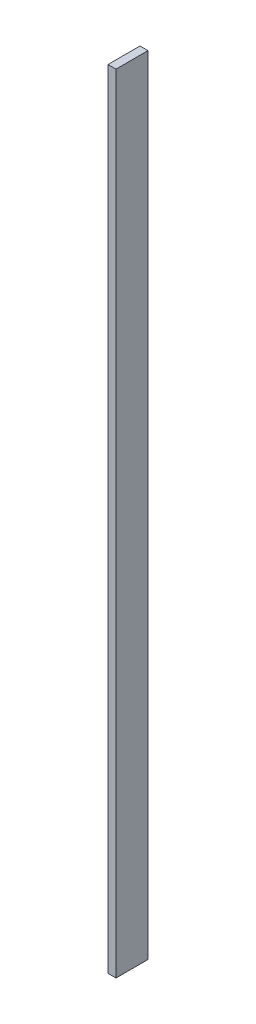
ISO-10303-21;
HEADER;
FILE_DESCRIPTION(('STEP AP214'),'2;1');
FILE_NAME('part.step','',(''),(''),'','','');
FILE_SCHEMA(('AUTOMOTIVE_DESIGN { 1 0 10303 214 1 1 1 1 }'));
ENDSEC;
DATA;
#1=APPLICATION_CONTEXT('core data for automotive mechanical design processes');
#2=APPLICATION_PROTOCOL_DEFINITION('international standard','automotive_design',2000,#1);
#3=PRODUCT_CONTEXT('',#1,'mechanical');
#4=PRODUCT('Part','Part','',(#3));
#5=PRODUCT_RELATED_PRODUCT_CATEGORY('part','',(#4));
#6=PRODUCT_DEFINITION_FORMATION('','',#4);
#7=PRODUCT_DEFINITION_CONTEXT('part definition',#1,'design');
#8=PRODUCT_DEFINITION('design','',#6,#7);
#9=PRODUCT_DEFINITION_SHAPE('','',#8);
#10=(LENGTH_UNIT() NAMED_UNIT(*) SI_UNIT(.MILLI.,.METRE.));
#11=(NAMED_UNIT(*) PLANE_ANGLE_UNIT() SI_UNIT($,.RADIAN.));
#12=(NAMED_UNIT(*) SI_UNIT($,.STERADIAN.) SOLID_ANGLE_UNIT());
#13=UNCERTAINTY_MEASURE_WITH_UNIT(LENGTH_MEASURE(1.E-05),#10,'distance_accuracy_value','');
#14=(GEOMETRIC_REPRESENTATION_CONTEXT(3) GLOBAL_UNCERTAINTY_ASSIGNED_CONTEXT((#13)) GLOBAL_UNIT_ASSIGNED_CONTEXT((#10,
#11,#12)) REPRESENTATION_CONTEXT('',''));
#15=CARTESIAN_POINT('',(0.,0.,0.));
#16=DIRECTION('',(0.,0.,1.));
#17=DIRECTION('',(1.,0.,0.));
#18=AXIS2_PLACEMENT_3D('',#15,#16,#17);
#19=CARTESIAN_POINT('',(6.35,0.,0.));
#20=DIRECTION('',(0.,0.,-1.));
#21=DIRECTION('',(0.,1.,0.));
#22=AXIS2_PLACEMENT_3D('',#19,#20,#21);
#23=PLANE('',#22);
#24=DIRECTION('',(0.,-1.,0.));
#25=VECTOR('',#24,1.);
#26=CARTESIAN_POINT('',(0.,0.,0.));
#27=LINE('',#26,#25);
#28=CARTESIAN_POINT('',(0.,0.,0.));
#29=VERTEX_POINT('',#28);
#30=CARTESIAN_POINT('',(0.,-624.84,0.));
#31=VERTEX_POINT('',#30);
#32=EDGE_CURVE('E96',#29,#31,#27,.T.);
#33=ORIENTED_EDGE('',*,*,#32,.T.);
#34=DIRECTION('',(-1.,0.,0.));
#35=VECTOR('',#34,1.);
#36=CARTESIAN_POINT('',(6.35,-624.84,0.));
#37=LINE('',#36,#35);
#38=CARTESIAN_POINT('',(6.35,-624.84,0.));
#39=VERTEX_POINT('',#38);
#40=EDGE_CURVE('E11',#39,#31,#37,.T.);
#41=ORIENTED_EDGE('',*,*,#40,.F.);
#42=DIRECTION('',(0.,-1.,0.));
#43=VECTOR('',#42,1.);
#44=CARTESIAN_POINT('',(6.35,0.,0.));
#45=LINE('',#44,#43);
#46=CARTESIAN_POINT('',(6.35,0.,0.));
#47=VERTEX_POINT('',#46);
#48=EDGE_CURVE('E84',#47,#39,#45,.T.);
#49=ORIENTED_EDGE('',*,*,#48,.F.);
#50=DIRECTION('',(-1.,0.,0.));
#51=VECTOR('',#50,1.);
#52=CARTESIAN_POINT('',(6.35,0.,0.));
#53=LINE('',#52,#51);
#54=EDGE_CURVE('E92',#47,#29,#53,.T.);
#55=ORIENTED_EDGE('',*,*,#54,.T.);
#56=EDGE_LOOP('',(#33,#41,#49,#55));
#57=FACE_BOUND('',#56,.T.);
#58=ADVANCED_FACE('F33',(#57),#23,.F.);
#59=CARTESIAN_POINT('',(6.35,-624.84,0.));
#60=DIRECTION('',(0.,1.,0.));
#61=DIRECTION('',(0.,0.,1.));
#62=AXIS2_PLACEMENT_3D('',#59,#60,#61);
#63=PLANE('',#62);
#64=DIRECTION('',(0.,0.,-1.));
#65=VECTOR('',#64,1.);
#66=CARTESIAN_POINT('',(0.,-624.84,0.));
#67=LINE('',#66,#65);
#68=CARTESIAN_POINT('',(0.,-624.84,-25.4000000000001));
#69=VERTEX_POINT('',#68);
#70=EDGE_CURVE('E88',#31,#69,#67,.T.);
#71=ORIENTED_EDGE('',*,*,#70,.T.);
#72=DIRECTION('',(-1.,0.,0.));
#73=VECTOR('',#72,1.);
#74=CARTESIAN_POINT('',(6.35,-624.84,-25.4000000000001));
#75=LINE('',#74,#73);
#76=CARTESIAN_POINT('',(6.35,-624.84,-25.4000000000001));
#77=VERTEX_POINT('',#76);
#78=EDGE_CURVE('E41',#77,#69,#75,.T.);
#79=ORIENTED_EDGE('',*,*,#78,.F.);
#80=DIRECTION('',(0.,0.,-1.));
#81=VECTOR('',#80,1.);
#82=CARTESIAN_POINT('',(6.35,-624.84,0.));
#83=LINE('',#82,#81);
#84=EDGE_CURVE('E79',#39,#77,#83,.T.);
#85=ORIENTED_EDGE('',*,*,#84,.F.);
#86=ORIENTED_EDGE('',*,*,#40,.T.);
#87=EDGE_LOOP('',(#71,#79,#85,#86));
#88=FACE_BOUND('',#87,.T.);
#89=ADVANCED_FACE('F87',(#88),#63,.F.);
#90=CARTESIAN_POINT('',(6.35,0.,-25.4));
#91=DIRECTION('',(0.,0.,1.));
#92=DIRECTION('',(0.,-1.,0.));
#93=AXIS2_PLACEMENT_3D('',#90,#91,#92);
#94=PLANE('',#93);
#95=DIRECTION('',(0.,1.,0.));
#96=VECTOR('',#95,1.);
#97=CARTESIAN_POINT('',(0.,0.,-25.4));
#98=LINE('',#97,#96);
#99=CARTESIAN_POINT('',(0.,0.,-25.4));
#100=VERTEX_POINT('',#99);
#101=EDGE_CURVE('E66',#69,#100,#98,.T.);
#102=ORIENTED_EDGE('',*,*,#101,.T.);
#103=DIRECTION('',(-1.,0.,0.));
#104=VECTOR('',#103,1.);
#105=CARTESIAN_POINT('',(6.35,0.,-25.4));
#106=LINE('',#105,#104);
#107=CARTESIAN_POINT('',(6.35,0.,-25.4));
#108=VERTEX_POINT('',#107);
#109=EDGE_CURVE('E89',#108,#100,#106,.T.);
#110=ORIENTED_EDGE('',*,*,#109,.F.);
#111=DIRECTION('',(0.,1.,0.));
#112=VECTOR('',#111,1.);
#113=CARTESIAN_POINT('',(6.35,0.,-25.4));
#114=LINE('',#113,#112);
#115=EDGE_CURVE('E82',#77,#108,#114,.T.);
#116=ORIENTED_EDGE('',*,*,#115,.F.);
#117=ORIENTED_EDGE('',*,*,#78,.T.);
#118=EDGE_LOOP('',(#102,#110,#116,#117));
#119=FACE_BOUND('',#118,.T.);
#120=ADVANCED_FACE('F90',(#119),#94,.F.);
#121=CARTESIAN_POINT('',(6.35,0.,0.));
#122=DIRECTION('',(0.,-1.,0.));
#123=DIRECTION('',(0.,0.,-1.));
#124=AXIS2_PLACEMENT_3D('',#121,#122,#123);
#125=PLANE('',#124);
#126=DIRECTION('',(0.,0.,1.));
#127=VECTOR('',#126,1.);
#128=CARTESIAN_POINT('',(0.,0.,0.));
#129=LINE('',#128,#127);
#130=EDGE_CURVE('E72',#100,#29,#129,.T.);
#131=ORIENTED_EDGE('',*,*,#130,.T.);
#132=ORIENTED_EDGE('',*,*,#54,.F.);
#133=DIRECTION('',(0.,0.,1.));
#134=VECTOR('',#133,1.);
#135=CARTESIAN_POINT('',(6.35,0.,0.));
#136=LINE('',#135,#134);
#137=EDGE_CURVE('E49',#108,#47,#136,.T.);
#138=ORIENTED_EDGE('',*,*,#137,.F.);
#139=ORIENTED_EDGE('',*,*,#109,.T.);
#140=EDGE_LOOP('',(#131,#132,#138,#139));
#141=FACE_BOUND('',#140,.T.);
#142=ADVANCED_FACE('F103',(#141),#125,.F.);
#143=CARTESIAN_POINT('',(6.35,0.,0.));
#144=DIRECTION('',(1.,0.,0.));
#145=DIRECTION('',(0.,0.,-1.));
#146=AXIS2_PLACEMENT_3D('',#143,#144,#145);
#147=PLANE('',#146);
#148=ORIENTED_EDGE('',*,*,#48,.T.);
#149=ORIENTED_EDGE('',*,*,#84,.T.);
#150=ORIENTED_EDGE('',*,*,#115,.T.);
#151=ORIENTED_EDGE('',*,*,#137,.T.);
#152=EDGE_LOOP('',(#148,#149,#150,#151));
#153=FACE_BOUND('',#152,.T.);
#154=ADVANCED_FACE('F80',(#153),#147,.T.);
#155=CARTESIAN_POINT('',(0.,0.,0.));
#156=DIRECTION('',(1.,0.,0.));
#157=DIRECTION('',(0.,0.,-1.));
#158=AXIS2_PLACEMENT_3D('',#155,#156,#157);
#159=PLANE('',#158);
#160=ORIENTED_EDGE('',*,*,#32,.F.);
#161=ORIENTED_EDGE('',*,*,#130,.F.);
#162=ORIENTED_EDGE('',*,*,#101,.F.);
#163=ORIENTED_EDGE('',*,*,#70,.F.);
#164=EDGE_LOOP('',(#160,#161,#162,#163));
#165=FACE_BOUND('',#164,.T.);
#166=ADVANCED_FACE('F106',(#165),#159,.F.);
#167=CLOSED_SHELL('',(#58,#89,#120,#142,#154,#166));
#168=MANIFOLD_SOLID_BREP('B2',#167);
#169=ADVANCED_BREP_SHAPE_REPRESENTATION('',(#18,#168),#14);
#170=SHAPE_DEFINITION_REPRESENTATION(#9,#169);
ENDSEC;
END-ISO-10303-21;
